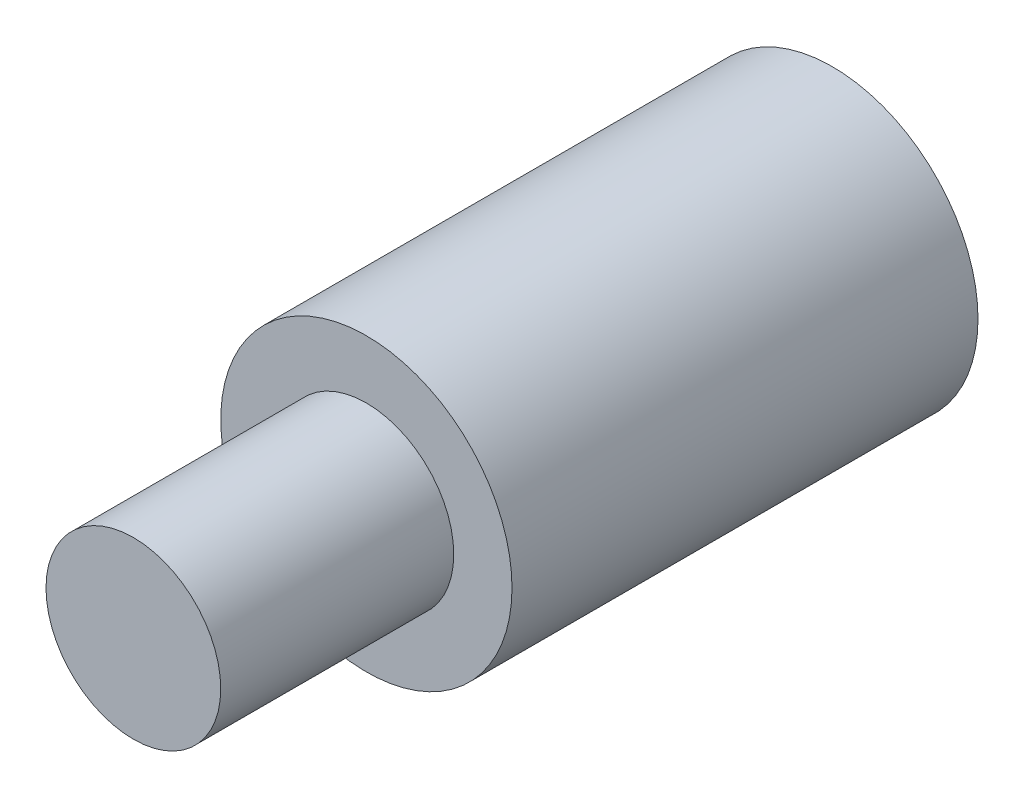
from build123d import *

# Parameters (mm, degrees)
ESQUISSE1_R               = 2.5
EXTRUSION1_DEPTH          = 8
ESQUISSE2_R               = 1.5
EXTRUSION2_DEPTH          = 4
TROU_TARAUD_M3X0_51_D     = 2.5
TROU_TARAUD_M3X0_51_DEPTH = 7.5
TROU_TARAUD_M3X0_51_TIP   = 0.751075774


with BuildPart() as part:
    # Esquisse1 → Extrusion1 (new body)
    with BuildSketch(Plane.XY):
        Circle(ESQUISSE1_R)
    extrude(amount=EXTRUSION1_DEPTH)

    # Esquisse2 → Extrusion2 (add)
    with BuildSketch(Plane.XY.offset(8)):
        Circle(ESQUISSE2_R)
    extrude(amount=EXTRUSION2_DEPTH)

    # Trou taraud_ M3x0.51
    with Locations(Plane(origin=(0, 0, 0), x_dir=(-1, 0, 0), z_dir=(0, 0, -1))):
        with Locations((0, 0)):
            Hole(TROU_TARAUD_M3X0_51_D / 2, depth=TROU_TARAUD_M3X0_51_DEPTH)
            with Locations((0, 0, -(TROU_TARAUD_M3X0_51_DEPTH + TROU_TARAUD_M3X0_51_TIP / 2))):  # 118° drill point
                Cone(0, TROU_TARAUD_M3X0_51_D / 2, TROU_TARAUD_M3X0_51_TIP, mode=Mode.SUBTRACT)


solid = part.part
